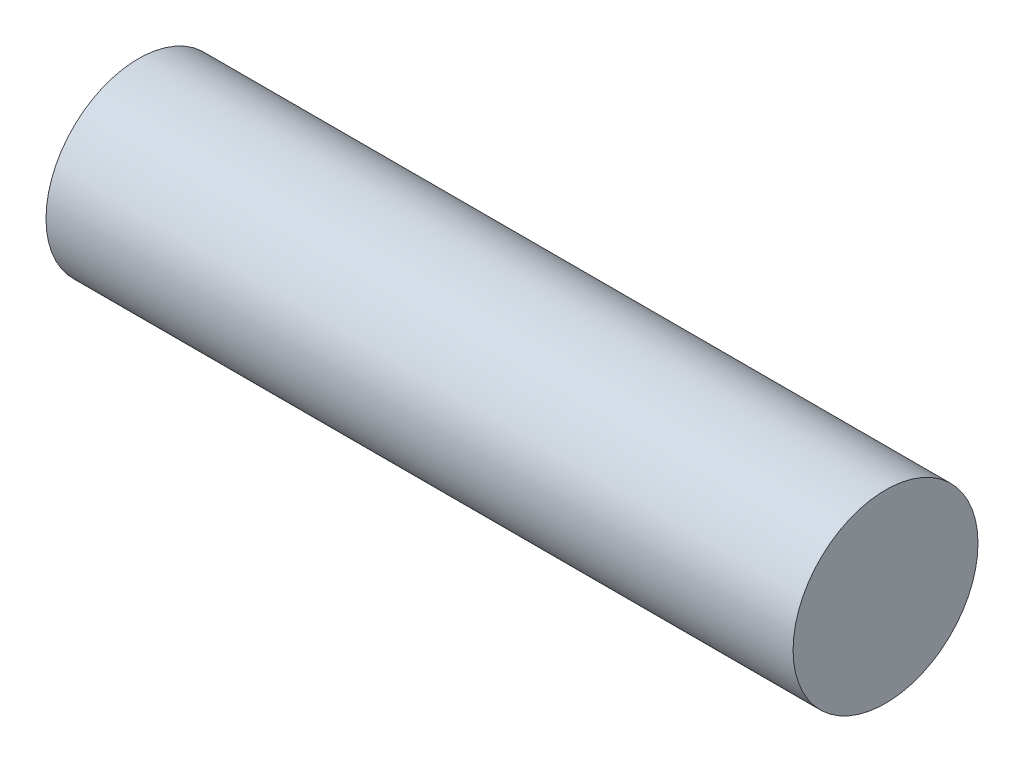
ISO-10303-21;
HEADER;
FILE_DESCRIPTION(('STEP AP214'),'2;1');
FILE_NAME('part.step','',(''),(''),'','','');
FILE_SCHEMA(('AUTOMOTIVE_DESIGN { 1 0 10303 214 1 1 1 1 }'));
ENDSEC;
DATA;
#1=APPLICATION_CONTEXT('core data for automotive mechanical design processes');
#2=APPLICATION_PROTOCOL_DEFINITION('international standard','automotive_design',2000,#1);
#3=PRODUCT_CONTEXT('',#1,'mechanical');
#4=PRODUCT('Part','Part','',(#3));
#5=PRODUCT_RELATED_PRODUCT_CATEGORY('part','',(#4));
#6=PRODUCT_DEFINITION_FORMATION('','',#4);
#7=PRODUCT_DEFINITION_CONTEXT('part definition',#1,'design');
#8=PRODUCT_DEFINITION('design','',#6,#7);
#9=PRODUCT_DEFINITION_SHAPE('','',#8);
#10=(LENGTH_UNIT() NAMED_UNIT(*) SI_UNIT(.MILLI.,.METRE.));
#11=(NAMED_UNIT(*) PLANE_ANGLE_UNIT() SI_UNIT($,.RADIAN.));
#12=(NAMED_UNIT(*) SI_UNIT($,.STERADIAN.) SOLID_ANGLE_UNIT());
#13=UNCERTAINTY_MEASURE_WITH_UNIT(LENGTH_MEASURE(1.E-05),#10,'distance_accuracy_value','');
#14=(GEOMETRIC_REPRESENTATION_CONTEXT(3) GLOBAL_UNCERTAINTY_ASSIGNED_CONTEXT((#13)) GLOBAL_UNIT_ASSIGNED_CONTEXT((#10,
#11,#12)) REPRESENTATION_CONTEXT('',''));
#15=CARTESIAN_POINT('',(0.,0.,0.));
#16=DIRECTION('',(0.,0.,1.));
#17=DIRECTION('',(1.,0.,0.));
#18=AXIS2_PLACEMENT_3D('',#15,#16,#17);
#19=CARTESIAN_POINT('',(-0.253999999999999,0.,0.));
#20=DIRECTION('',(1.,0.,0.));
#21=DIRECTION('',(0.,0.,-1.));
#22=AXIS2_PLACEMENT_3D('',#19,#20,#21);
#23=CYLINDRICAL_SURFACE('',#22,3.175);
#24=CARTESIAN_POINT('',(-0.253999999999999,0.,0.));
#25=DIRECTION('',(1.,0.,0.));
#26=DIRECTION('',(0.,0.,-1.));
#27=AXIS2_PLACEMENT_3D('',#24,#25,#26);
#28=CIRCLE('',#27,3.175);
#29=CARTESIAN_POINT('',(-0.253999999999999,0.,-3.175));
#30=VERTEX_POINT('',#29);
#31=EDGE_CURVE('E10',#30,#30,#28,.T.);
#32=ORIENTED_EDGE('',*,*,#31,.T.);
#33=EDGE_LOOP('',(#32));
#34=FACE_BOUND('',#33,.T.);
#35=CARTESIAN_POINT('',(25.4,0.,0.));
#36=DIRECTION('',(1.,0.,0.));
#37=DIRECTION('',(0.,0.,-1.));
#38=AXIS2_PLACEMENT_3D('',#35,#36,#37);
#39=CIRCLE('',#38,3.175);
#40=CARTESIAN_POINT('',(25.4,0.,-3.175));
#41=VERTEX_POINT('',#40);
#42=EDGE_CURVE('E49',#41,#41,#39,.T.);
#43=ORIENTED_EDGE('',*,*,#42,.F.);
#44=EDGE_LOOP('',(#43));
#45=FACE_BOUND('',#44,.T.);
#46=ADVANCED_FACE('F42',(#34,#45),#23,.T.);
#47=CARTESIAN_POINT('',(-0.253999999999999,0.,0.));
#48=DIRECTION('',(1.,0.,0.));
#49=DIRECTION('',(0.,0.,-1.));
#50=AXIS2_PLACEMENT_3D('',#47,#48,#49);
#51=PLANE('',#50);
#52=ORIENTED_EDGE('',*,*,#31,.F.);
#53=EDGE_LOOP('',(#52));
#54=FACE_BOUND('',#53,.T.);
#55=ADVANCED_FACE('F59',(#54),#51,.F.);
#56=CARTESIAN_POINT('',(25.4,0.,0.));
#57=DIRECTION('',(1.,0.,0.));
#58=DIRECTION('',(0.,0.,-1.));
#59=AXIS2_PLACEMENT_3D('',#56,#57,#58);
#60=PLANE('',#59);
#61=ORIENTED_EDGE('',*,*,#42,.T.);
#62=EDGE_LOOP('',(#61));
#63=FACE_BOUND('',#62,.T.);
#64=ADVANCED_FACE('F56',(#63),#60,.T.);
#65=CLOSED_SHELL('',(#46,#55,#64));
#66=MANIFOLD_SOLID_BREP('B2',#65);
#67=ADVANCED_BREP_SHAPE_REPRESENTATION('',(#18,#66),#14);
#68=SHAPE_DEFINITION_REPRESENTATION(#9,#67);
ENDSEC;
END-ISO-10303-21;
